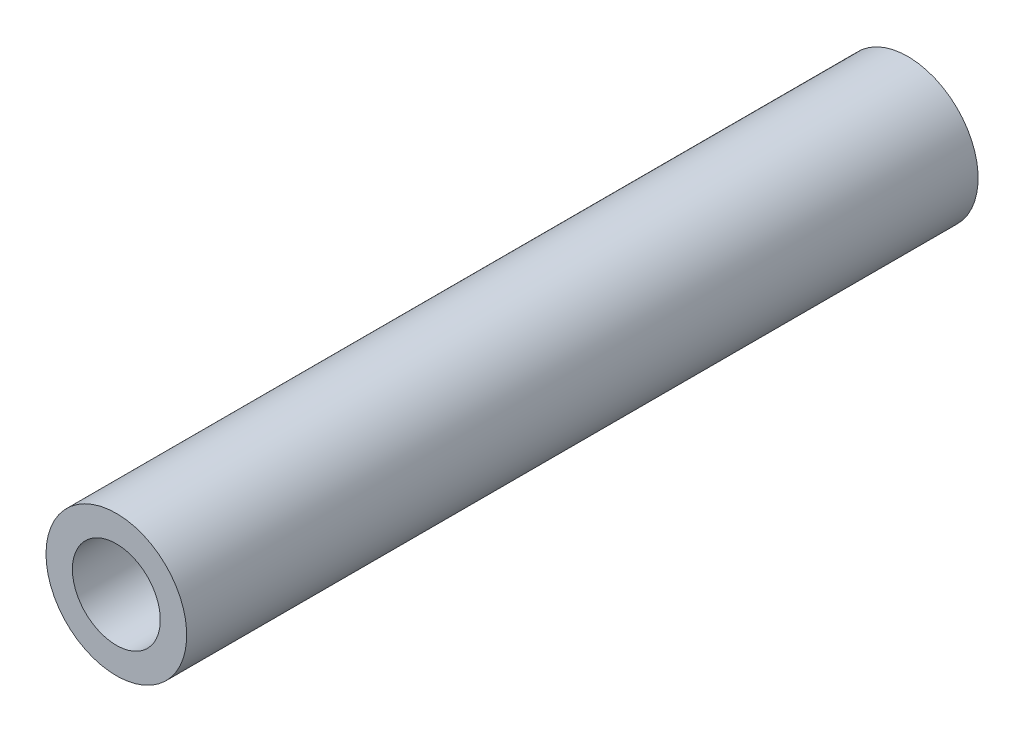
ISO-10303-21;
HEADER;
FILE_DESCRIPTION(('STEP AP214'),'2;1');
FILE_NAME('part.step','',(''),(''),'','','');
FILE_SCHEMA(('AUTOMOTIVE_DESIGN { 1 0 10303 214 1 1 1 1 }'));
ENDSEC;
DATA;
#1=APPLICATION_CONTEXT('core data for automotive mechanical design processes');
#2=APPLICATION_PROTOCOL_DEFINITION('international standard','automotive_design',2000,#1);
#3=PRODUCT_CONTEXT('',#1,'mechanical');
#4=PRODUCT('Part','Part','',(#3));
#5=PRODUCT_RELATED_PRODUCT_CATEGORY('part','',(#4));
#6=PRODUCT_DEFINITION_FORMATION('','',#4);
#7=PRODUCT_DEFINITION_CONTEXT('part definition',#1,'design');
#8=PRODUCT_DEFINITION('design','',#6,#7);
#9=PRODUCT_DEFINITION_SHAPE('','',#8);
#10=(LENGTH_UNIT() NAMED_UNIT(*) SI_UNIT(.MILLI.,.METRE.));
#11=(NAMED_UNIT(*) PLANE_ANGLE_UNIT() SI_UNIT($,.RADIAN.));
#12=(NAMED_UNIT(*) SI_UNIT($,.STERADIAN.) SOLID_ANGLE_UNIT());
#13=UNCERTAINTY_MEASURE_WITH_UNIT(LENGTH_MEASURE(1.E-05),#10,'distance_accuracy_value','');
#14=(GEOMETRIC_REPRESENTATION_CONTEXT(3) GLOBAL_UNCERTAINTY_ASSIGNED_CONTEXT((#13)) GLOBAL_UNIT_ASSIGNED_CONTEXT((#10,
#11,#12)) REPRESENTATION_CONTEXT('',''));
#15=CARTESIAN_POINT('',(0.,0.,0.));
#16=DIRECTION('',(0.,0.,1.));
#17=DIRECTION('',(1.,0.,0.));
#18=AXIS2_PLACEMENT_3D('',#15,#16,#17);
#19=CARTESIAN_POINT('',(0.,0.,44.9999999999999));
#20=DIRECTION('',(0.,0.,1.));
#21=DIRECTION('',(1.,0.,0.));
#22=AXIS2_PLACEMENT_3D('',#19,#20,#21);
#23=PLANE('',#22);
#24=CARTESIAN_POINT('',(0.,0.,44.9999999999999));
#25=DIRECTION('',(0.,0.,1.));
#26=DIRECTION('',(1.,0.,0.));
#27=AXIS2_PLACEMENT_3D('',#24,#25,#26);
#28=CIRCLE('',#27,4.);
#29=CARTESIAN_POINT('',(-3.99999999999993,0.,44.9999999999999));
#30=VERTEX_POINT('',#29);
#31=EDGE_CURVE('E10',#30,#30,#28,.T.);
#32=ORIENTED_EDGE('',*,*,#31,.T.);
#33=EDGE_LOOP('',(#32));
#34=FACE_BOUND('',#33,.T.);
#35=CARTESIAN_POINT('',(0.,0.,44.9999999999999));
#36=DIRECTION('',(0.,0.,1.));
#37=DIRECTION('',(1.,0.,0.));
#38=AXIS2_PLACEMENT_3D('',#35,#36,#37);
#39=CIRCLE('',#38,2.5);
#40=CARTESIAN_POINT('',(-2.49999999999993,0.,44.9999999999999));
#41=VERTEX_POINT('',#40);
#42=EDGE_CURVE('E40',#41,#41,#39,.T.);
#43=ORIENTED_EDGE('',*,*,#42,.F.);
#44=EDGE_LOOP('',(#43));
#45=FACE_BOUND('',#44,.T.);
#46=ADVANCED_FACE('F29',(#34,#45),#23,.T.);
#47=CARTESIAN_POINT('',(0.,0.,0.));
#48=DIRECTION('',(0.,0.,1.));
#49=DIRECTION('',(1.,0.,0.));
#50=AXIS2_PLACEMENT_3D('',#47,#48,#49);
#51=PLANE('',#50);
#52=CARTESIAN_POINT('',(0.,0.,0.));
#53=DIRECTION('',(0.,0.,1.));
#54=DIRECTION('',(1.,0.,0.));
#55=AXIS2_PLACEMENT_3D('',#52,#53,#54);
#56=CIRCLE('',#55,4.);
#57=CARTESIAN_POINT('',(-3.99999999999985,0.,0.));
#58=VERTEX_POINT('',#57);
#59=EDGE_CURVE('E36',#58,#58,#56,.T.);
#60=ORIENTED_EDGE('',*,*,#59,.F.);
#61=EDGE_LOOP('',(#60));
#62=FACE_BOUND('',#61,.T.);
#63=CARTESIAN_POINT('',(0.,0.,0.));
#64=DIRECTION('',(0.,0.,1.));
#65=DIRECTION('',(1.,0.,0.));
#66=AXIS2_PLACEMENT_3D('',#63,#64,#65);
#67=CIRCLE('',#66,2.5);
#68=CARTESIAN_POINT('',(-2.49999999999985,0.,0.));
#69=VERTEX_POINT('',#68);
#70=EDGE_CURVE('E44',#69,#69,#67,.T.);
#71=ORIENTED_EDGE('',*,*,#70,.T.);
#72=EDGE_LOOP('',(#71));
#73=FACE_BOUND('',#72,.T.);
#74=ADVANCED_FACE('F50',(#62,#73),#51,.F.);
#75=CARTESIAN_POINT('',(0.,0.,44.9999999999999));
#76=DIRECTION('',(0.,0.,-1.));
#77=DIRECTION('',(-1.,0.,0.));
#78=AXIS2_PLACEMENT_3D('',#75,#76,#77);
#79=CYLINDRICAL_SURFACE('',#78,4.);
#80=CARTESIAN_POINT('',(-3.99999999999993,0.,44.9999999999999));
#81=CARTESIAN_POINT('',(-3.99999999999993,0.,44.5312499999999));
#82=CARTESIAN_POINT('',(-3.99999999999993,0.,44.0624999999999));
#83=CARTESIAN_POINT('',(-3.99999999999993,0.,43.1249999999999));
#84=CARTESIAN_POINT('',(-3.99999999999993,0.,42.6562499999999));
#85=CARTESIAN_POINT('',(-3.99999999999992,0.,41.7187499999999));
#86=CARTESIAN_POINT('',(-3.99999999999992,0.,41.2499999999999));
#87=CARTESIAN_POINT('',(-3.99999999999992,0.,40.3124999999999));
#88=CARTESIAN_POINT('',(-3.99999999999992,0.,39.8437499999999));
#89=CARTESIAN_POINT('',(-3.99999999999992,0.,38.9062499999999));
#90=CARTESIAN_POINT('',(-3.99999999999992,0.,38.4374999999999));
#91=CARTESIAN_POINT('',(-3.99999999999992,0.,37.4999999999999));
#92=CARTESIAN_POINT('',(-3.99999999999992,0.,37.0312499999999));
#93=CARTESIAN_POINT('',(-3.99999999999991,0.,36.0937499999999));
#94=CARTESIAN_POINT('',(-3.99999999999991,0.,35.6249999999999));
#95=CARTESIAN_POINT('',(-3.99999999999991,0.,34.6874999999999));
#96=CARTESIAN_POINT('',(-3.99999999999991,0.,34.2187499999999));
#97=CARTESIAN_POINT('',(-3.99999999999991,0.,33.2812499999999));
#98=CARTESIAN_POINT('',(-3.99999999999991,0.,32.8124999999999));
#99=CARTESIAN_POINT('',(-3.99999999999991,0.,31.8749999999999));
#100=CARTESIAN_POINT('',(-3.99999999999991,0.,31.4062499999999));
#101=CARTESIAN_POINT('',(-3.9999999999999,0.,30.4687499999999));
#102=CARTESIAN_POINT('',(-3.9999999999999,0.,29.9999999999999));
#103=CARTESIAN_POINT('',(-3.9999999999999,0.,29.0624999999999));
#104=CARTESIAN_POINT('',(-3.9999999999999,0.,28.5937499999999));
#105=CARTESIAN_POINT('',(-3.9999999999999,0.,27.6562499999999));
#106=CARTESIAN_POINT('',(-3.9999999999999,0.,27.1874999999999));
#107=CARTESIAN_POINT('',(-3.9999999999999,0.,26.2499999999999));
#108=CARTESIAN_POINT('',(-3.9999999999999,0.,25.7812499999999));
#109=CARTESIAN_POINT('',(-3.9999999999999,0.,24.8437499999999));
#110=CARTESIAN_POINT('',(-3.99999999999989,0.,24.3749999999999));
#111=CARTESIAN_POINT('',(-3.99999999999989,0.,23.4374999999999));
#112=CARTESIAN_POINT('',(-3.99999999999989,0.,22.9687499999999));
#113=CARTESIAN_POINT('',(-3.99999999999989,0.,22.0312499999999));
#114=CARTESIAN_POINT('',(-3.99999999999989,0.,21.5624999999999));
#115=CARTESIAN_POINT('',(-3.99999999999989,0.,20.6249999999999));
#116=CARTESIAN_POINT('',(-3.99999999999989,0.,20.15625));
#117=CARTESIAN_POINT('',(-3.99999999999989,0.,19.21875));
#118=CARTESIAN_POINT('',(-3.99999999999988,0.,18.75));
#119=CARTESIAN_POINT('',(-3.99999999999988,0.,17.8125));
#120=CARTESIAN_POINT('',(-3.99999999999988,0.,17.34375));
#121=CARTESIAN_POINT('',(-3.99999999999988,0.,16.40625));
#122=CARTESIAN_POINT('',(-3.99999999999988,0.,15.9375));
#123=CARTESIAN_POINT('',(-3.99999999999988,0.,15.));
#124=CARTESIAN_POINT('',(-3.99999999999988,0.,14.53125));
#125=CARTESIAN_POINT('',(-3.99999999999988,0.,13.59375));
#126=CARTESIAN_POINT('',(-3.99999999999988,0.,13.125));
#127=CARTESIAN_POINT('',(-3.99999999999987,0.,12.1875));
#128=CARTESIAN_POINT('',(-3.99999999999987,0.,11.71875));
#129=CARTESIAN_POINT('',(-3.99999999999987,0.,10.78125));
#130=CARTESIAN_POINT('',(-3.99999999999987,0.,10.3125));
#131=CARTESIAN_POINT('',(-3.99999999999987,0.,9.37499999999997));
#132=CARTESIAN_POINT('',(-3.99999999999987,0.,8.90624999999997));
#133=CARTESIAN_POINT('',(-3.99999999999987,0.,7.96874999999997));
#134=CARTESIAN_POINT('',(-3.99999999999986,0.,7.49999999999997));
#135=CARTESIAN_POINT('',(-3.99999999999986,0.,6.56249999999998));
#136=CARTESIAN_POINT('',(-3.99999999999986,0.,6.09374999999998));
#137=CARTESIAN_POINT('',(-3.99999999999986,0.,5.15624999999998));
#138=CARTESIAN_POINT('',(-3.99999999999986,0.,4.68749999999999));
#139=CARTESIAN_POINT('',(-3.99999999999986,0.,3.74999999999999));
#140=CARTESIAN_POINT('',(-3.99999999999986,0.,3.28124999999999));
#141=CARTESIAN_POINT('',(-3.99999999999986,0.,2.34374999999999));
#142=CARTESIAN_POINT('',(-3.99999999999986,0.,1.87499999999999));
#143=CARTESIAN_POINT('',(-3.99999999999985,0.,0.937499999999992));
#144=CARTESIAN_POINT('',(-3.99999999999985,0.,0.468749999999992));
#145=CARTESIAN_POINT('',(-3.99999999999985,0.,0.));
#146=B_SPLINE_CURVE_WITH_KNOTS('',3,(#80,#81,#82,#83,#84,#85,#86,#87,#88,#89,#90,#91,#92,#93,
#94,#95,#96,#97,#98,#99,#100,#101,#102,#103,#104,#105,#106,#107,#108,#109,#110,#111,#112,#113,
#114,#115,#116,#117,#118,#119,#120,#121,#122,#123,#124,#125,#126,#127,#128,#129,#130,#131,#132,
#133,#134,#135,#136,#137,#138,#139,#140,#141,#142,#143,#144,#145),.UNSPECIFIED.,.F.,.F.,(4,2,2,
2,2,2,2,2,2,2,2,2,2,2,2,2,2,2,2,2,2,2,2,2,2,2,2,2,2,2,2,2,4),(0.,1.40624999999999,
2.81249999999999,4.21874999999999,5.62499999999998,7.03124999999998,8.43749999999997,
9.84374999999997,11.25,12.65625,14.0625,15.46875,16.875,18.28125,19.6874999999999,
21.0937499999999,22.4999999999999,23.9062499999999,25.3124999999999,26.7187499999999,
28.1249999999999,29.5312499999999,30.9374999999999,32.3437499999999,33.7499999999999,
35.1562499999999,36.5624999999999,37.9687499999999,39.3749999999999,40.7812499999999,
42.1874999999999,43.5937499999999,44.9999999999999),.UNSPECIFIED.);
#147=EDGE_CURVE('BSEAM31',#30,#58,#146,.T.);
#148=ORIENTED_EDGE('',*,*,#31,.F.);
#149=ORIENTED_EDGE('',*,*,#59,.T.);
#150=ORIENTED_EDGE('',*,*,#147,.T.);
#151=ORIENTED_EDGE('',*,*,#147,.F.);
#152=EDGE_LOOP('',(#148,#150,#149,#151));
#153=FACE_BOUND('',#152,.T.);
#154=ADVANCED_FACE('F31',(#153),#79,.T.);
#155=CARTESIAN_POINT('',(0.,0.,44.9999999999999));
#156=DIRECTION('',(0.,0.,-1.));
#157=DIRECTION('',(-1.,0.,0.));
#158=AXIS2_PLACEMENT_3D('',#155,#156,#157);
#159=CYLINDRICAL_SURFACE('',#158,2.5);
#160=CARTESIAN_POINT('',(-2.49999999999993,0.,44.9999999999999));
#161=CARTESIAN_POINT('',(-2.49999999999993,0.,44.5312499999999));
#162=CARTESIAN_POINT('',(-2.49999999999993,0.,44.0624999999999));
#163=CARTESIAN_POINT('',(-2.49999999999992,0.,43.1249999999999));
#164=CARTESIAN_POINT('',(-2.49999999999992,0.,42.6562499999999));
#165=CARTESIAN_POINT('',(-2.49999999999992,0.,41.7187499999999));
#166=CARTESIAN_POINT('',(-2.49999999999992,0.,41.2499999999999));
#167=CARTESIAN_POINT('',(-2.49999999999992,0.,40.3124999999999));
#168=CARTESIAN_POINT('',(-2.49999999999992,0.,39.8437499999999));
#169=CARTESIAN_POINT('',(-2.49999999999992,0.,38.9062499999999));
#170=CARTESIAN_POINT('',(-2.49999999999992,0.,38.4374999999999));
#171=CARTESIAN_POINT('',(-2.49999999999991,0.,37.4999999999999));
#172=CARTESIAN_POINT('',(-2.49999999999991,0.,37.0312499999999));
#173=CARTESIAN_POINT('',(-2.49999999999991,0.,36.0937499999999));
#174=CARTESIAN_POINT('',(-2.49999999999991,0.,35.6249999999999));
#175=CARTESIAN_POINT('',(-2.49999999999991,0.,34.6874999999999));
#176=CARTESIAN_POINT('',(-2.49999999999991,0.,34.2187499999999));
#177=CARTESIAN_POINT('',(-2.49999999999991,0.,33.2812499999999));
#178=CARTESIAN_POINT('',(-2.49999999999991,0.,32.8124999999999));
#179=CARTESIAN_POINT('',(-2.4999999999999,0.,31.8749999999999));
#180=CARTESIAN_POINT('',(-2.4999999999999,0.,31.4062499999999));
#181=CARTESIAN_POINT('',(-2.4999999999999,0.,30.4687499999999));
#182=CARTESIAN_POINT('',(-2.4999999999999,0.,29.9999999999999));
#183=CARTESIAN_POINT('',(-2.4999999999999,0.,29.0624999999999));
#184=CARTESIAN_POINT('',(-2.4999999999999,0.,28.5937499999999));
#185=CARTESIAN_POINT('',(-2.4999999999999,0.,27.6562499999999));
#186=CARTESIAN_POINT('',(-2.4999999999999,0.,27.1874999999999));
#187=CARTESIAN_POINT('',(-2.4999999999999,0.,26.2499999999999));
#188=CARTESIAN_POINT('',(-2.49999999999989,0.,25.7812499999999));
#189=CARTESIAN_POINT('',(-2.49999999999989,0.,24.8437499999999));
#190=CARTESIAN_POINT('',(-2.49999999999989,0.,24.3749999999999));
#191=CARTESIAN_POINT('',(-2.49999999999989,0.,23.4374999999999));
#192=CARTESIAN_POINT('',(-2.49999999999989,0.,22.9687499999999));
#193=CARTESIAN_POINT('',(-2.49999999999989,0.,22.0312499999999));
#194=CARTESIAN_POINT('',(-2.49999999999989,0.,21.5624999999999));
#195=CARTESIAN_POINT('',(-2.49999999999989,0.,20.6249999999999));
#196=CARTESIAN_POINT('',(-2.49999999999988,0.,20.15625));
#197=CARTESIAN_POINT('',(-2.49999999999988,0.,19.21875));
#198=CARTESIAN_POINT('',(-2.49999999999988,0.,18.75));
#199=CARTESIAN_POINT('',(-2.49999999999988,0.,17.8125));
#200=CARTESIAN_POINT('',(-2.49999999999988,0.,17.34375));
#201=CARTESIAN_POINT('',(-2.49999999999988,0.,16.40625));
#202=CARTESIAN_POINT('',(-2.49999999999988,0.,15.9375));
#203=CARTESIAN_POINT('',(-2.49999999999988,0.,15.));
#204=CARTESIAN_POINT('',(-2.49999999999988,0.,14.53125));
#205=CARTESIAN_POINT('',(-2.49999999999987,0.,13.59375));
#206=CARTESIAN_POINT('',(-2.49999999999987,0.,13.125));
#207=CARTESIAN_POINT('',(-2.49999999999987,0.,12.1875));
#208=CARTESIAN_POINT('',(-2.49999999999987,0.,11.71875));
#209=CARTESIAN_POINT('',(-2.49999999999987,0.,10.78125));
#210=CARTESIAN_POINT('',(-2.49999999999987,0.,10.3125));
#211=CARTESIAN_POINT('',(-2.49999999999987,0.,9.37499999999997));
#212=CARTESIAN_POINT('',(-2.49999999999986,0.,8.90624999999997));
#213=CARTESIAN_POINT('',(-2.49999999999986,0.,7.96874999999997));
#214=CARTESIAN_POINT('',(-2.49999999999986,0.,7.49999999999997));
#215=CARTESIAN_POINT('',(-2.49999999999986,0.,6.56249999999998));
#216=CARTESIAN_POINT('',(-2.49999999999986,0.,6.09374999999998));
#217=CARTESIAN_POINT('',(-2.49999999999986,0.,5.15624999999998));
#218=CARTESIAN_POINT('',(-2.49999999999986,0.,4.68749999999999));
#219=CARTESIAN_POINT('',(-2.49999999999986,0.,3.74999999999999));
#220=CARTESIAN_POINT('',(-2.49999999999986,0.,3.28124999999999));
#221=CARTESIAN_POINT('',(-2.49999999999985,0.,2.34374999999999));
#222=CARTESIAN_POINT('',(-2.49999999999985,0.,1.87499999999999));
#223=CARTESIAN_POINT('',(-2.49999999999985,0.,0.937499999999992));
#224=CARTESIAN_POINT('',(-2.49999999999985,0.,0.468749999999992));
#225=CARTESIAN_POINT('',(-2.49999999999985,0.,0.));
#226=B_SPLINE_CURVE_WITH_KNOTS('',3,(#160,#161,#162,#163,#164,#165,#166,#167,#168,#169,#170,
#171,#172,#173,#174,#175,#176,#177,#178,#179,#180,#181,#182,#183,#184,#185,#186,#187,#188,#189,
#190,#191,#192,#193,#194,#195,#196,#197,#198,#199,#200,#201,#202,#203,#204,#205,#206,#207,#208,
#209,#210,#211,#212,#213,#214,#215,#216,#217,#218,#219,#220,#221,#222,#223,#224,#225),
.UNSPECIFIED.,.F.,.F.,(4,2,2,2,2,2,2,2,2,2,2,2,2,2,2,2,2,2,2,2,2,2,2,2,2,2,2,2,2,2,2,2,4),(0.,
1.40624999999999,2.81249999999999,4.21874999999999,5.62499999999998,7.03124999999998,
8.43749999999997,9.84374999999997,11.25,12.65625,14.0625,15.46875,16.875,18.28125,
19.6874999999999,21.0937499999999,22.4999999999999,23.9062499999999,25.3124999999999,
26.7187499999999,28.1249999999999,29.5312499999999,30.9374999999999,32.3437499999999,
33.7499999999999,35.1562499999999,36.5624999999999,37.9687499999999,39.3749999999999,
40.7812499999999,42.1874999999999,43.5937499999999,44.9999999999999),.UNSPECIFIED.);
#227=EDGE_CURVE('BSEAM52',#41,#69,#226,.T.);
#228=ORIENTED_EDGE('',*,*,#42,.T.);
#229=ORIENTED_EDGE('',*,*,#70,.F.);
#230=ORIENTED_EDGE('',*,*,#227,.T.);
#231=ORIENTED_EDGE('',*,*,#227,.F.);
#232=EDGE_LOOP('',(#228,#230,#229,#231));
#233=FACE_BOUND('',#232,.T.);
#234=ADVANCED_FACE('F52',(#233),#159,.F.);
#235=CLOSED_SHELL('',(#46,#74,#154,#234));
#236=MANIFOLD_SOLID_BREP('B2',#235);
#237=ADVANCED_BREP_SHAPE_REPRESENTATION('',(#18,#236),#14);
#238=SHAPE_DEFINITION_REPRESENTATION(#9,#237);
ENDSEC;
END-ISO-10303-21;
